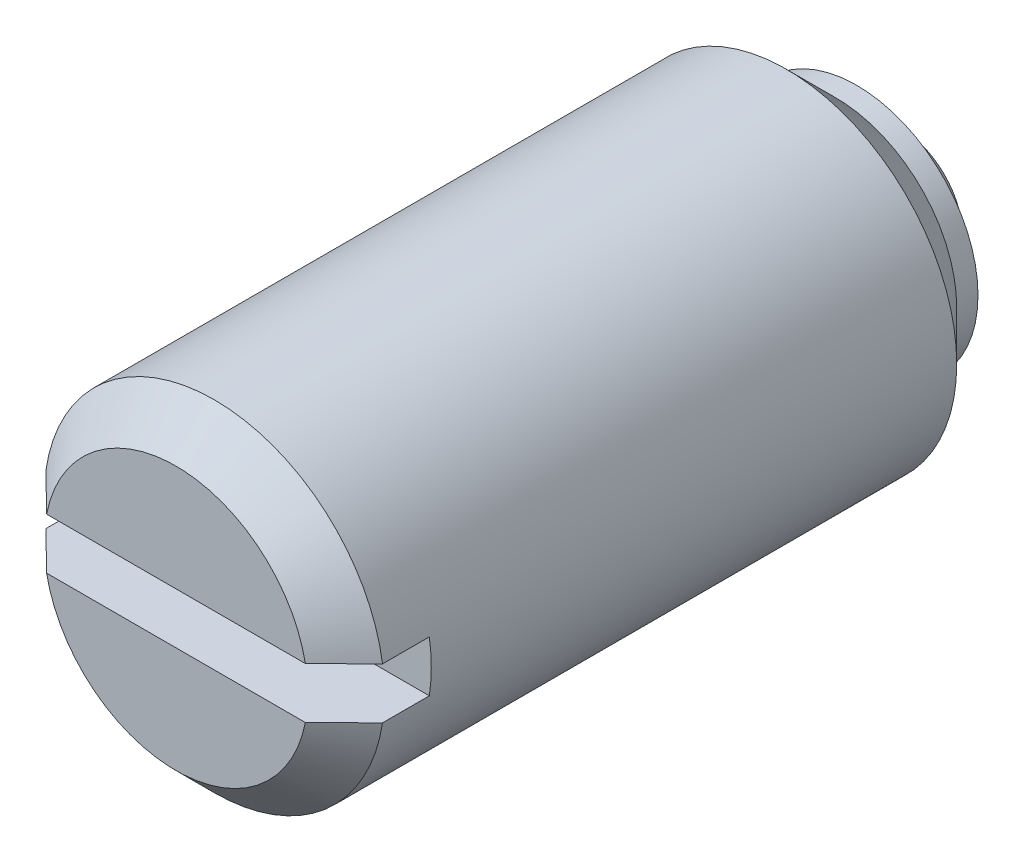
ISO-10303-21;
HEADER;
FILE_DESCRIPTION(('STEP AP214'),'2;1');
FILE_NAME('part.step','',(''),(''),'','','');
FILE_SCHEMA(('AUTOMOTIVE_DESIGN { 1 0 10303 214 1 1 1 1 }'));
ENDSEC;
DATA;
#1=APPLICATION_CONTEXT('core data for automotive mechanical design processes');
#2=APPLICATION_PROTOCOL_DEFINITION('international standard','automotive_design',2000,#1);
#3=PRODUCT_CONTEXT('',#1,'mechanical');
#4=PRODUCT('Part','Part','',(#3));
#5=PRODUCT_RELATED_PRODUCT_CATEGORY('part','',(#4));
#6=PRODUCT_DEFINITION_FORMATION('','',#4);
#7=PRODUCT_DEFINITION_CONTEXT('part definition',#1,'design');
#8=PRODUCT_DEFINITION('design','',#6,#7);
#9=PRODUCT_DEFINITION_SHAPE('','',#8);
#10=(LENGTH_UNIT() NAMED_UNIT(*) SI_UNIT(.MILLI.,.METRE.));
#11=(NAMED_UNIT(*) PLANE_ANGLE_UNIT() SI_UNIT($,.RADIAN.));
#12=(NAMED_UNIT(*) SI_UNIT($,.STERADIAN.) SOLID_ANGLE_UNIT());
#13=UNCERTAINTY_MEASURE_WITH_UNIT(LENGTH_MEASURE(1.E-05),#10,'distance_accuracy_value','');
#14=(GEOMETRIC_REPRESENTATION_CONTEXT(3) GLOBAL_UNCERTAINTY_ASSIGNED_CONTEXT((#13)) GLOBAL_UNIT_ASSIGNED_CONTEXT((#10,
#11,#12)) REPRESENTATION_CONTEXT('',''));
#15=CARTESIAN_POINT('',(0.,0.,0.));
#16=DIRECTION('',(0.,0.,1.));
#17=DIRECTION('',(1.,0.,0.));
#18=AXIS2_PLACEMENT_3D('',#15,#16,#17);
#19=CARTESIAN_POINT('',(0.,0.,-2.5));
#20=DIRECTION('',(0.,0.,-1.));
#21=DIRECTION('',(-1.,0.,0.));
#22=AXIS2_PLACEMENT_3D('',#19,#20,#21);
#23=CYLINDRICAL_SURFACE('',#22,4.);
#24=DIRECTION('',(0.,0.,1.));
#25=VECTOR('',#24,1.);
#26=CARTESIAN_POINT('',(3.95474398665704,-0.6,15.5));
#27=LINE('',#26,#25);
#28=CARTESIAN_POINT('',(3.95474398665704,-0.6,15.5));
#29=VERTEX_POINT('',#28);
#30=CARTESIAN_POINT('',(3.95474398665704,-0.6,16.6));
#31=VERTEX_POINT('',#30);
#32=EDGE_CURVE('E84',#29,#31,#27,.T.);
#33=ORIENTED_EDGE('',*,*,#32,.T.);
#34=CARTESIAN_POINT('',(0.,0.,16.6));
#35=DIRECTION('',(0.,0.,1.));
#36=DIRECTION('',(1.,0.,0.));
#37=AXIS2_PLACEMENT_3D('',#34,#35,#36);
#38=CIRCLE('',#37,4.);
#39=CARTESIAN_POINT('',(-3.95474398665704,-0.6,16.6));
#40=VERTEX_POINT('',#39);
#41=EDGE_CURVE('E90',#31,#40,#38,.F.);
#42=ORIENTED_EDGE('',*,*,#41,.T.);
#43=DIRECTION('',(0.,0.,1.));
#44=VECTOR('',#43,1.);
#45=CARTESIAN_POINT('',(-3.95474398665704,-0.6,15.5));
#46=LINE('',#45,#44);
#47=CARTESIAN_POINT('',(-3.95474398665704,-0.6,15.5));
#48=VERTEX_POINT('',#47);
#49=EDGE_CURVE('E82',#48,#40,#46,.T.);
#50=ORIENTED_EDGE('',*,*,#49,.F.);
#51=CARTESIAN_POINT('',(0.,0.,15.5));
#52=DIRECTION('',(0.,0.,1.));
#53=DIRECTION('',(1.,0.,0.));
#54=AXIS2_PLACEMENT_3D('',#51,#52,#53);
#55=CIRCLE('',#54,4.);
#56=CARTESIAN_POINT('',(-3.95474398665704,0.6,15.5));
#57=VERTEX_POINT('',#56);
#58=EDGE_CURVE('E66',#57,#48,#55,.T.);
#59=ORIENTED_EDGE('',*,*,#58,.F.);
#60=DIRECTION('',(0.,0.,1.));
#61=VECTOR('',#60,1.);
#62=CARTESIAN_POINT('',(-3.95474398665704,0.6,15.5));
#63=LINE('',#62,#61);
#64=CARTESIAN_POINT('',(-3.95474398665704,0.6,16.6));
#65=VERTEX_POINT('',#64);
#66=EDGE_CURVE('E97',#57,#65,#63,.T.);
#67=ORIENTED_EDGE('',*,*,#66,.T.);
#68=CARTESIAN_POINT('',(0.,0.,16.6));
#69=DIRECTION('',(0.,0.,1.));
#70=DIRECTION('',(1.,0.,0.));
#71=AXIS2_PLACEMENT_3D('',#68,#69,#70);
#72=CIRCLE('',#71,4.);
#73=CARTESIAN_POINT('',(3.95474398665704,0.6,16.6));
#74=VERTEX_POINT('',#73);
#75=EDGE_CURVE('E102',#65,#74,#72,.F.);
#76=ORIENTED_EDGE('',*,*,#75,.T.);
#77=DIRECTION('',(0.,0.,1.));
#78=VECTOR('',#77,1.);
#79=CARTESIAN_POINT('',(3.95474398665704,0.6,15.5));
#80=LINE('',#79,#78);
#81=CARTESIAN_POINT('',(3.95474398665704,0.6,15.5));
#82=VERTEX_POINT('',#81);
#83=EDGE_CURVE('E92',#82,#74,#80,.T.);
#84=ORIENTED_EDGE('',*,*,#83,.F.);
#85=EDGE_CURVE('E78',#29,#82,#55,.T.);
#86=ORIENTED_EDGE('',*,*,#85,.F.);
#87=EDGE_LOOP('',(#33,#42,#50,#59,#67,#76,#84,#86));
#88=FACE_BOUND('',#87,.T.);
#89=CARTESIAN_POINT('',(0.,0.,3.15));
#90=DIRECTION('',(0.,0.,1.));
#91=DIRECTION('',(1.,0.,0.));
#92=AXIS2_PLACEMENT_3D('',#89,#90,#91);
#93=CIRCLE('',#92,4.);
#94=CARTESIAN_POINT('',(4.,0.,3.15));
#95=VERTEX_POINT('',#94);
#96=EDGE_CURVE('E166',#95,#95,#93,.T.);
#97=ORIENTED_EDGE('',*,*,#96,.T.);
#98=EDGE_LOOP('',(#97));
#99=FACE_BOUND('',#98,.T.);
#100=ADVANCED_FACE('F15',(#88,#99),#23,.T.);
#101=CARTESIAN_POINT('',(0.,4.,17.5));
#102=DIRECTION('',(0.,0.,1.));
#103=DIRECTION('',(1.,0.,0.));
#104=AXIS2_PLACEMENT_3D('',#101,#102,#103);
#105=PLANE('',#104);
#106=DIRECTION('',(1.,0.,0.));
#107=VECTOR('',#106,1.);
#108=CARTESIAN_POINT('',(-3.95474398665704,0.6,17.5));
#109=LINE('',#108,#107);
#110=CARTESIAN_POINT('',(-3.04138126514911,0.6,17.5));
#111=VERTEX_POINT('',#110);
#112=CARTESIAN_POINT('',(3.04138126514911,0.6,17.5));
#113=VERTEX_POINT('',#112);
#114=EDGE_CURVE('E76',#111,#113,#109,.T.);
#115=ORIENTED_EDGE('',*,*,#114,.T.);
#116=CARTESIAN_POINT('',(0.,0.,17.5));
#117=DIRECTION('',(0.,0.,1.));
#118=DIRECTION('',(1.,0.,0.));
#119=AXIS2_PLACEMENT_3D('',#116,#117,#118);
#120=CIRCLE('',#119,3.1);
#121=EDGE_CURVE('E9',#113,#111,#120,.T.);
#122=ORIENTED_EDGE('',*,*,#121,.T.);
#123=EDGE_LOOP('',(#115,#122));
#124=FACE_BOUND('',#123,.T.);
#125=ADVANCED_FACE('F183',(#124),#105,.T.);
#126=DIRECTION('',(1.,0.,0.));
#127=VECTOR('',#126,1.);
#128=CARTESIAN_POINT('',(-3.95474398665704,-0.6,17.5));
#129=LINE('',#128,#127);
#130=CARTESIAN_POINT('',(-3.04138126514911,-0.6,17.5));
#131=VERTEX_POINT('',#130);
#132=CARTESIAN_POINT('',(3.04138126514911,-0.6,17.5));
#133=VERTEX_POINT('',#132);
#134=EDGE_CURVE('E153',#131,#133,#129,.T.);
#135=ORIENTED_EDGE('',*,*,#134,.F.);
#136=CARTESIAN_POINT('',(0.,0.,17.5));
#137=DIRECTION('',(0.,0.,1.));
#138=DIRECTION('',(1.,0.,0.));
#139=AXIS2_PLACEMENT_3D('',#136,#137,#138);
#140=CIRCLE('',#139,3.1);
#141=EDGE_CURVE('E147',#131,#133,#140,.T.);
#142=ORIENTED_EDGE('',*,*,#141,.T.);
#143=EDGE_LOOP('',(#135,#142));
#144=FACE_BOUND('',#143,.T.);
#145=ADVANCED_FACE('F133',(#144),#105,.T.);
#146=CARTESIAN_POINT('',(-3.95474398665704,0.6,15.5));
#147=DIRECTION('',(0.,-1.,0.));
#148=DIRECTION('',(1.,0.,0.));
#149=AXIS2_PLACEMENT_3D('',#146,#147,#148);
#150=PLANE('',#149);
#151=ORIENTED_EDGE('',*,*,#83,.T.);
#152=CARTESIAN_POINT('',(3.95474398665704,0.6,16.6));
#153=CARTESIAN_POINT('',(3.87875606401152,0.6,16.6751274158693));
#154=CARTESIAN_POINT('',(3.80274454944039,0.6,16.7502309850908));
#155=CARTESIAN_POINT('',(3.65066332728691,0.6,16.9003790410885));
#156=CARTESIAN_POINT('',(3.57459361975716,0.6,16.9754235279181));
#157=CARTESIAN_POINT('',(3.42238484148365,0.6,17.125442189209));
#158=CARTESIAN_POINT('',(3.34624577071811,0.6,17.2004163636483));
#159=CARTESIAN_POINT('',(3.19388188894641,0.6,17.3502776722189));
#160=CARTESIAN_POINT('',(3.11765707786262,0.6,17.4251648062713));
#161=CARTESIAN_POINT('',(3.04138126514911,0.6,17.5));
#162=B_SPLINE_CURVE_WITH_KNOTS('',3,(#152,#153,#154,#155,#156,#157,#158,#159,#160,#161),
.UNSPECIFIED.,.F.,.F.,(4,2,2,2,4),(0.,0.320569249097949,0.641138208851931,0.961707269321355,
1.28227662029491),.UNSPECIFIED.);
#163=EDGE_CURVE('E24',#74,#113,#162,.T.);
#164=ORIENTED_EDGE('',*,*,#163,.T.);
#165=ORIENTED_EDGE('',*,*,#114,.F.);
#166=CARTESIAN_POINT('',(-3.04138126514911,0.6,17.5));
#167=CARTESIAN_POINT('',(-3.11765707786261,0.6,17.4251648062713));
#168=CARTESIAN_POINT('',(-3.19388188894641,0.6,17.3502776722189));
#169=CARTESIAN_POINT('',(-3.34624577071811,0.6,17.2004163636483));
#170=CARTESIAN_POINT('',(-3.42238484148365,0.6,17.125442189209));
#171=CARTESIAN_POINT('',(-3.57459361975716,0.6,16.9754235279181));
#172=CARTESIAN_POINT('',(-3.65066332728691,0.6,16.9003790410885));
#173=CARTESIAN_POINT('',(-3.80274454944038,0.6,16.7502309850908));
#174=CARTESIAN_POINT('',(-3.87875606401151,0.6,16.6751274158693));
#175=CARTESIAN_POINT('',(-3.95474398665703,0.6,16.6));
#176=B_SPLINE_CURVE_WITH_KNOTS('',3,(#166,#167,#168,#169,#170,#171,#172,#173,#174,#175),
.UNSPECIFIED.,.F.,.F.,(4,2,2,2,4),(0.,0.320569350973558,0.641138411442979,0.96170737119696,
1.28227662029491),.UNSPECIFIED.);
#177=EDGE_CURVE('E138',#111,#65,#176,.T.);
#178=ORIENTED_EDGE('',*,*,#177,.T.);
#179=ORIENTED_EDGE('',*,*,#66,.F.);
#180=DIRECTION('',(1.,0.,0.));
#181=VECTOR('',#180,1.);
#182=CARTESIAN_POINT('',(-3.95474398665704,0.6,15.5));
#183=LINE('',#182,#181);
#184=EDGE_CURVE('E72',#57,#82,#183,.T.);
#185=ORIENTED_EDGE('',*,*,#184,.T.);
#186=EDGE_LOOP('',(#151,#164,#165,#178,#179,#185));
#187=FACE_BOUND('',#186,.T.);
#188=ADVANCED_FACE('F126',(#187),#150,.T.);
#189=CARTESIAN_POINT('',(-3.95474398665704,-0.6,15.5));
#190=DIRECTION('',(0.,-1.,0.));
#191=DIRECTION('',(1.,0.,0.));
#192=AXIS2_PLACEMENT_3D('',#189,#190,#191);
#193=PLANE('',#192);
#194=ORIENTED_EDGE('',*,*,#49,.T.);
#195=CARTESIAN_POINT('',(-3.95474398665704,-0.6,16.6));
#196=CARTESIAN_POINT('',(-3.87875606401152,-0.6,16.6751274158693));
#197=CARTESIAN_POINT('',(-3.80274454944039,-0.6,16.7502309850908));
#198=CARTESIAN_POINT('',(-3.65066332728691,-0.6,16.9003790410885));
#199=CARTESIAN_POINT('',(-3.57459361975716,-0.6,16.9754235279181));
#200=CARTESIAN_POINT('',(-3.42238484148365,-0.6,17.125442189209));
#201=CARTESIAN_POINT('',(-3.34624577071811,-0.6,17.2004163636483));
#202=CARTESIAN_POINT('',(-3.19388188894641,-0.6,17.3502776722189));
#203=CARTESIAN_POINT('',(-3.11765707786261,-0.6,17.4251648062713));
#204=CARTESIAN_POINT('',(-3.04138126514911,-0.6,17.5));
#205=B_SPLINE_CURVE_WITH_KNOTS('',3,(#195,#196,#197,#198,#199,#200,#201,#202,#203,#204),
.UNSPECIFIED.,.F.,.F.,(4,2,2,2,4),(0.,0.320569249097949,0.641138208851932,0.961707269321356,
1.28227662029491),.UNSPECIFIED.);
#206=EDGE_CURVE('E113',#40,#131,#205,.T.);
#207=ORIENTED_EDGE('',*,*,#206,.T.);
#208=ORIENTED_EDGE('',*,*,#134,.T.);
#209=CARTESIAN_POINT('',(3.04138126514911,-0.6,17.5));
#210=CARTESIAN_POINT('',(3.11765707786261,-0.6,17.4251648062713));
#211=CARTESIAN_POINT('',(3.19388188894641,-0.6,17.3502776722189));
#212=CARTESIAN_POINT('',(3.34624577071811,-0.6,17.2004163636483));
#213=CARTESIAN_POINT('',(3.42238484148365,-0.6,17.125442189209));
#214=CARTESIAN_POINT('',(3.57459361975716,-0.6,16.9754235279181));
#215=CARTESIAN_POINT('',(3.65066332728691,-0.6,16.9003790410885));
#216=CARTESIAN_POINT('',(3.80274454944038,-0.6,16.7502309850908));
#217=CARTESIAN_POINT('',(3.87875606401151,-0.6,16.6751274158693));
#218=CARTESIAN_POINT('',(3.95474398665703,-0.6,16.6));
#219=B_SPLINE_CURVE_WITH_KNOTS('',3,(#209,#210,#211,#212,#213,#214,#215,#216,#217,#218),
.UNSPECIFIED.,.F.,.F.,(4,2,2,2,4),(0.,0.320569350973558,0.641138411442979,0.96170737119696,
1.28227662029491),.UNSPECIFIED.);
#220=EDGE_CURVE('E106',#133,#31,#219,.T.);
#221=ORIENTED_EDGE('',*,*,#220,.T.);
#222=ORIENTED_EDGE('',*,*,#32,.F.);
#223=DIRECTION('',(1.,0.,0.));
#224=VECTOR('',#223,1.);
#225=CARTESIAN_POINT('',(-3.95474398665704,-0.6,15.5));
#226=LINE('',#225,#224);
#227=EDGE_CURVE('E69',#48,#29,#226,.T.);
#228=ORIENTED_EDGE('',*,*,#227,.F.);
#229=EDGE_LOOP('',(#194,#207,#208,#221,#222,#228));
#230=FACE_BOUND('',#229,.T.);
#231=ADVANCED_FACE('F81',(#230),#193,.F.);
#232=CARTESIAN_POINT('',(0.,0.,15.5));
#233=DIRECTION('',(0.,0.,1.));
#234=DIRECTION('',(1.,0.,0.));
#235=AXIS2_PLACEMENT_3D('',#232,#233,#234);
#236=PLANE('',#235);
#237=ORIENTED_EDGE('',*,*,#58,.T.);
#238=ORIENTED_EDGE('',*,*,#227,.T.);
#239=ORIENTED_EDGE('',*,*,#85,.T.);
#240=ORIENTED_EDGE('',*,*,#184,.F.);
#241=EDGE_LOOP('',(#237,#238,#239,#240));
#242=FACE_BOUND('',#241,.T.);
#243=ADVANCED_FACE('F68',(#242),#236,.T.);
#244=CARTESIAN_POINT('',(0.,0.,19.480272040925));
#245=DIRECTION('',(0.,0.,1.));
#246=DIRECTION('',(1.,0.,0.));
#247=AXIS2_PLACEMENT_3D('',#244,#245,#246);
#248=CYLINDRICAL_SURFACE('',#247,2.85);
#249=CARTESIAN_POINT('',(0.,0.,1.5));
#250=DIRECTION('',(0.,0.,1.));
#251=DIRECTION('',(1.,0.,0.));
#252=AXIS2_PLACEMENT_3D('',#249,#250,#251);
#253=CIRCLE('',#252,2.85);
#254=CARTESIAN_POINT('',(2.85,0.,1.5));
#255=VERTEX_POINT('',#254);
#256=EDGE_CURVE('E156',#255,#255,#253,.T.);
#257=ORIENTED_EDGE('',*,*,#256,.T.);
#258=EDGE_LOOP('',(#257));
#259=FACE_BOUND('',#258,.T.);
#260=CARTESIAN_POINT('',(0.,0.,2.));
#261=DIRECTION('',(0.,0.,1.));
#262=DIRECTION('',(1.,0.,0.));
#263=AXIS2_PLACEMENT_3D('',#260,#261,#262);
#264=CIRCLE('',#263,2.85);
#265=CARTESIAN_POINT('',(2.85,0.,2.));
#266=VERTEX_POINT('',#265);
#267=EDGE_CURVE('E163',#266,#266,#264,.T.);
#268=ORIENTED_EDGE('',*,*,#267,.F.);
#269=EDGE_LOOP('',(#268));
#270=FACE_BOUND('',#269,.T.);
#271=ADVANCED_FACE('F127',(#259,#270),#248,.T.);
#272=CARTESIAN_POINT('',(0.,0.,3.15));
#273=DIRECTION('',(0.,0.,1.));
#274=DIRECTION('',(1.,0.,0.));
#275=AXIS2_PLACEMENT_3D('',#272,#273,#274);
#276=CONICAL_SURFACE('',#275,4.,0.785398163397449);
#277=ORIENTED_EDGE('',*,*,#267,.T.);
#278=EDGE_LOOP('',(#277));
#279=FACE_BOUND('',#278,.T.);
#280=ORIENTED_EDGE('',*,*,#96,.F.);
#281=EDGE_LOOP('',(#280));
#282=FACE_BOUND('',#281,.T.);
#283=ADVANCED_FACE('F170',(#279,#282),#276,.T.);
#284=CARTESIAN_POINT('',(0.,0.,2.5));
#285=DIRECTION('',(-1.,0.,0.));
#286=DIRECTION('',(0.,0.,1.));
#287=AXIS2_PLACEMENT_3D('',#284,#285,#286);
#288=SPHERICAL_SURFACE('',#287,2.5);
#289=CARTESIAN_POINT('',(0.,0.,2.5));
#290=DIRECTION('',(0.,0.,-1.));
#291=DIRECTION('',(-1.,0.,0.));
#292=AXIS2_PLACEMENT_3D('',#289,#290,#291);
#293=SPHERICAL_SURFACE('',#292,2.5);
#294=CARTESIAN_POINT('',(0.,0.,1.5));
#295=DIRECTION('',(0.,0.,-1.));
#296=DIRECTION('',(-1.,0.,0.));
#297=AXIS2_PLACEMENT_3D('',#294,#295,#296);
#298=CIRCLE('',#297,2.29128784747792);
#299=CARTESIAN_POINT('',(-2.29128784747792,0.,1.5));
#300=VERTEX_POINT('',#299);
#301=EDGE_CURVE('E99',#300,#300,#298,.T.);
#302=ORIENTED_EDGE('',*,*,#301,.T.);
#303=EDGE_LOOP('',(#302));
#304=FACE_BOUND('',#303,.T.);
#305=ADVANCED_FACE('F172',(#304),#293,.T.);
#306=CARTESIAN_POINT('',(0.,2.29128784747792,1.5));
#307=DIRECTION('',(0.,0.,-1.));
#308=DIRECTION('',(-1.,0.,0.));
#309=AXIS2_PLACEMENT_3D('',#306,#307,#308);
#310=PLANE('',#309);
#311=ORIENTED_EDGE('',*,*,#301,.F.);
#312=EDGE_LOOP('',(#311));
#313=FACE_BOUND('',#312,.T.);
#314=ORIENTED_EDGE('',*,*,#256,.F.);
#315=EDGE_LOOP('',(#314));
#316=FACE_BOUND('',#315,.T.);
#317=ADVANCED_FACE('F134',(#313,#316),#310,.T.);
#318=CARTESIAN_POINT('',(0.,0.,16.6));
#319=DIRECTION('',(0.,0.,-1.));
#320=DIRECTION('',(-1.,0.,0.));
#321=AXIS2_PLACEMENT_3D('',#318,#319,#320);
#322=CONICAL_SURFACE('',#321,4.,0.785398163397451);
#323=ORIENTED_EDGE('',*,*,#220,.F.);
#324=ORIENTED_EDGE('',*,*,#141,.F.);
#325=ORIENTED_EDGE('',*,*,#206,.F.);
#326=ORIENTED_EDGE('',*,*,#41,.F.);
#327=EDGE_LOOP('',(#323,#324,#325,#326));
#328=FACE_BOUND('',#327,.T.);
#329=ADVANCED_FACE('F119',(#328),#322,.T.);
#330=CARTESIAN_POINT('',(0.,0.,16.6));
#331=DIRECTION('',(0.,0.,-1.));
#332=DIRECTION('',(-1.,0.,0.));
#333=AXIS2_PLACEMENT_3D('',#330,#331,#332);
#334=CONICAL_SURFACE('',#333,4.,0.785398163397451);
#335=ORIENTED_EDGE('',*,*,#177,.F.);
#336=ORIENTED_EDGE('',*,*,#121,.F.);
#337=ORIENTED_EDGE('',*,*,#163,.F.);
#338=ORIENTED_EDGE('',*,*,#75,.F.);
#339=EDGE_LOOP('',(#335,#336,#337,#338));
#340=FACE_BOUND('',#339,.T.);
#341=ADVANCED_FACE('F17',(#340),#334,.T.);
#342=CLOSED_SHELL('',(#100,#125,#145,#188,#231,#243,#271,#283,#305,#317,#329,#341));
#343=MANIFOLD_SOLID_BREP('B1',#342);
#344=ADVANCED_BREP_SHAPE_REPRESENTATION('',(#18,#343),#14);
#345=SHAPE_DEFINITION_REPRESENTATION(#9,#344);
ENDSEC;
END-ISO-10303-21;
